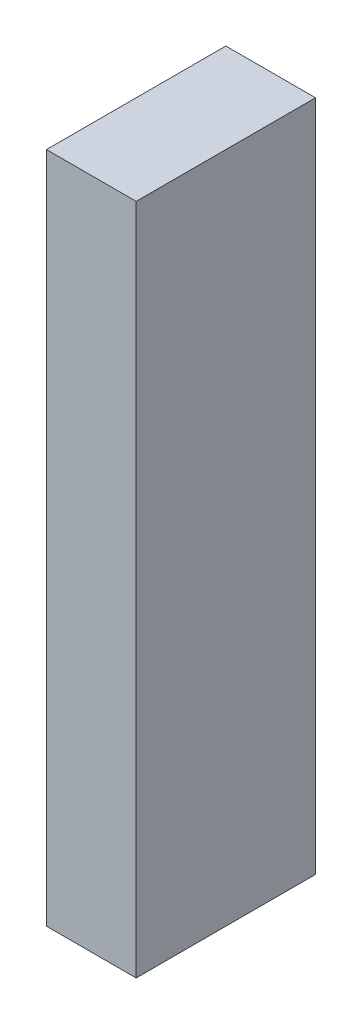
from build123d import *

# Parameters (mm, degrees)
SKETCH1_W           = 50
SKETCH1_H           = 100
BOSS_EXTRUDE1_DEPTH = 375


with BuildPart() as part:
    # Sketch1 → Boss-Extrude1 (new body)
    with BuildSketch(Plane(origin=(0, 0, 0), x_dir=(1, 0, 0), z_dir=(0, 1, 0))):
        Rectangle(SKETCH1_W, SKETCH1_H)
    extrude(amount=BOSS_EXTRUDE1_DEPTH)


solid = part.part
